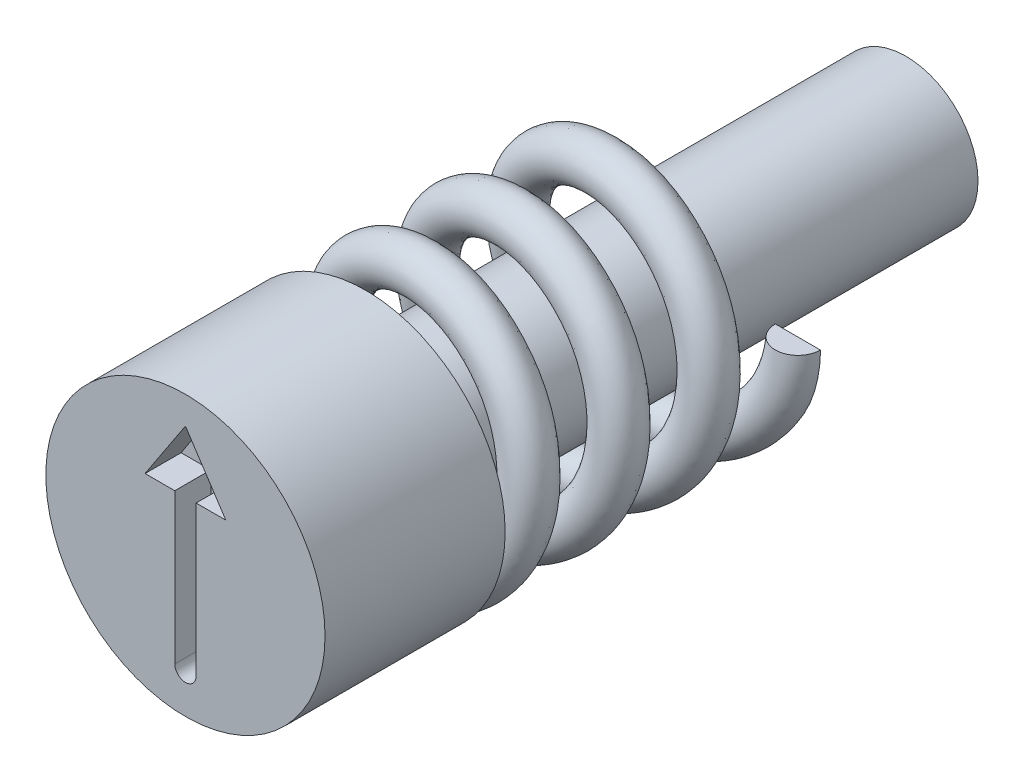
ISO-10303-21;
HEADER;
FILE_DESCRIPTION(('STEP AP214'),'2;1');
FILE_NAME('part.step','',(''),(''),'','','');
FILE_SCHEMA(('AUTOMOTIVE_DESIGN { 1 0 10303 214 1 1 1 1 }'));
ENDSEC;
DATA;
#1=APPLICATION_CONTEXT('core data for automotive mechanical design processes');
#2=APPLICATION_PROTOCOL_DEFINITION('international standard','automotive_design',2000,#1);
#3=PRODUCT_CONTEXT('',#1,'mechanical');
#4=PRODUCT('Part','Part','',(#3));
#5=PRODUCT_RELATED_PRODUCT_CATEGORY('part','',(#4));
#6=PRODUCT_DEFINITION_FORMATION('','',#4);
#7=PRODUCT_DEFINITION_CONTEXT('part definition',#1,'design');
#8=PRODUCT_DEFINITION('design','',#6,#7);
#9=PRODUCT_DEFINITION_SHAPE('','',#8);
#10=(LENGTH_UNIT() NAMED_UNIT(*) SI_UNIT(.MILLI.,.METRE.));
#11=(NAMED_UNIT(*) PLANE_ANGLE_UNIT() SI_UNIT($,.RADIAN.));
#12=(NAMED_UNIT(*) SI_UNIT($,.STERADIAN.) SOLID_ANGLE_UNIT());
#13=UNCERTAINTY_MEASURE_WITH_UNIT(LENGTH_MEASURE(1.E-05),#10,'distance_accuracy_value','');
#14=(GEOMETRIC_REPRESENTATION_CONTEXT(3) GLOBAL_UNCERTAINTY_ASSIGNED_CONTEXT((#13)) GLOBAL_UNIT_ASSIGNED_CONTEXT((#10,
#11,#12)) REPRESENTATION_CONTEXT('',''));
#15=CARTESIAN_POINT('',(0.,0.,0.));
#16=DIRECTION('',(0.,0.,1.));
#17=DIRECTION('',(1.,0.,0.));
#18=AXIS2_PLACEMENT_3D('',#15,#16,#17);
#19=CARTESIAN_POINT('',(1.3,0.,-5.75));
#20=DIRECTION('',(0.,-1.,0.));
#21=DIRECTION('',(0.,0.,-1.));
#22=AXIS2_PLACEMENT_3D('',#19,#20,#21);
#23=PLANE('',#22);
#24=CARTESIAN_POINT('',(1.3,0.,-5.5));
#25=DIRECTION('',(0.,1.,0.));
#26=DIRECTION('',(0.,0.,1.));
#27=AXIS2_PLACEMENT_3D('',#24,#25,#26);
#28=CIRCLE('',#27,0.25);
#29=CARTESIAN_POINT('',(1.05,0.,-5.5));
#30=VERTEX_POINT('',#29);
#31=CARTESIAN_POINT('',(1.55,0.,-5.5));
#32=VERTEX_POINT('',#31);
#33=EDGE_CURVE('E88',#30,#32,#28,.T.);
#34=ORIENTED_EDGE('',*,*,#33,.T.);
#35=DIRECTION('',(-1.,0.,0.));
#36=VECTOR('',#35,1.);
#37=CARTESIAN_POINT('',(1.3,0.,-5.5));
#38=LINE('',#37,#36);
#39=EDGE_CURVE('E75',#32,#30,#38,.T.);
#40=ORIENTED_EDGE('',*,*,#39,.T.);
#41=EDGE_LOOP('',(#34,#40));
#42=FACE_BOUND('',#41,.T.);
#43=ADVANCED_FACE('F49',(#42),#23,.F.);
#44=CARTESIAN_POINT('',(-1.3,0.,-2.25));
#45=DIRECTION('',(0.,1.,0.));
#46=DIRECTION('',(-1.,0.,0.));
#47=AXIS2_PLACEMENT_3D('',#44,#45,#46);
#48=PLANE('',#47);
#49=DIRECTION('',(-1.,0.,0.));
#50=VECTOR('',#49,1.);
#51=CARTESIAN_POINT('',(-1.3,0.,-2.));
#52=LINE('',#51,#50);
#53=CARTESIAN_POINT('',(-1.05,0.,-2.));
#54=VERTEX_POINT('',#53);
#55=CARTESIAN_POINT('',(-1.55,0.,-2.));
#56=VERTEX_POINT('',#55);
#57=EDGE_CURVE('E69',#54,#56,#52,.T.);
#58=ORIENTED_EDGE('',*,*,#57,.F.);
#59=CARTESIAN_POINT('',(-1.3,0.,-2.));
#60=DIRECTION('',(0.,1.,0.));
#61=DIRECTION('',(-1.,0.,0.));
#62=AXIS2_PLACEMENT_3D('',#59,#60,#61);
#63=CIRCLE('',#62,0.25);
#64=EDGE_CURVE('E85',#54,#56,#63,.T.);
#65=ORIENTED_EDGE('',*,*,#64,.T.);
#66=EDGE_LOOP('',(#58,#65));
#67=FACE_BOUND('',#66,.T.);
#68=ADVANCED_FACE('F51',(#67),#48,.T.);
#69=CARTESIAN_POINT('',(1.3,0.,-5.25));
#70=CARTESIAN_POINT('',(1.3,-0.538477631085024,-5.1875));
#71=CARTESIAN_POINT('',(0.919238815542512,-0.919238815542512,-5.125));
#72=CARTESIAN_POINT('',(0.538477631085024,-1.3,-5.0625));
#73=CARTESIAN_POINT('',(0.,-1.3,-5.));
#74=CARTESIAN_POINT('',(-0.538477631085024,-1.3,-4.9375));
#75=CARTESIAN_POINT('',(-0.919238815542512,-0.919238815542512,-4.875));
#76=CARTESIAN_POINT('',(-1.3,-0.538477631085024,-4.8125));
#77=CARTESIAN_POINT('',(-1.3,0.,-4.75));
#78=CARTESIAN_POINT('',(-1.3,0.538477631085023,-4.6875));
#79=CARTESIAN_POINT('',(-0.919238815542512,0.919238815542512,-4.625));
#80=CARTESIAN_POINT('',(-0.538477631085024,1.3,-4.5625));
#81=CARTESIAN_POINT('',(0.,1.3,-4.5));
#82=CARTESIAN_POINT('',(0.538477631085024,1.3,-4.4375));
#83=CARTESIAN_POINT('',(0.919238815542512,0.919238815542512,-4.375));
#84=CARTESIAN_POINT('',(1.3,0.538477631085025,-4.3125));
#85=CARTESIAN_POINT('',(1.3,0.,-4.25));
#86=CARTESIAN_POINT('',(1.3,-0.538477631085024,-4.1875));
#87=CARTESIAN_POINT('',(0.919238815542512,-0.919238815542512,-4.125));
#88=CARTESIAN_POINT('',(0.538477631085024,-1.3,-4.0625));
#89=CARTESIAN_POINT('',(0.,-1.3,-4.));
#90=CARTESIAN_POINT('',(-0.538477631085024,-1.3,-3.9375));
#91=CARTESIAN_POINT('',(-0.919238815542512,-0.919238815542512,-3.875));
#92=CARTESIAN_POINT('',(-1.3,-0.538477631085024,-3.8125));
#93=CARTESIAN_POINT('',(-1.3,0.,-3.75));
#94=CARTESIAN_POINT('',(-1.3,0.538477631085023,-3.6875));
#95=CARTESIAN_POINT('',(-0.919238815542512,0.919238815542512,-3.625));
#96=CARTESIAN_POINT('',(-0.538477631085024,1.3,-3.5625));
#97=CARTESIAN_POINT('',(0.,1.3,-3.5));
#98=CARTESIAN_POINT('',(0.538477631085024,1.3,-3.4375));
#99=CARTESIAN_POINT('',(0.919238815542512,0.919238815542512,-3.375));
#100=CARTESIAN_POINT('',(1.3,0.538477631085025,-3.3125));
#101=CARTESIAN_POINT('',(1.3,0.,-3.25));
#102=CARTESIAN_POINT('',(1.3,-0.538477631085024,-3.1875));
#103=CARTESIAN_POINT('',(0.919238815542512,-0.919238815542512,-3.125));
#104=CARTESIAN_POINT('',(0.538477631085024,-1.3,-3.0625));
#105=CARTESIAN_POINT('',(0.,-1.3,-3.));
#106=CARTESIAN_POINT('',(-0.538477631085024,-1.3,-2.9375));
#107=CARTESIAN_POINT('',(-0.919238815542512,-0.919238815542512,-2.875));
#108=CARTESIAN_POINT('',(-1.3,-0.538477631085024,-2.8125));
#109=CARTESIAN_POINT('',(-1.3,0.,-2.75));
#110=CARTESIAN_POINT('',(-1.3,0.538477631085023,-2.6875));
#111=CARTESIAN_POINT('',(-0.919238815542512,0.919238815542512,-2.625));
#112=CARTESIAN_POINT('',(-0.538477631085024,1.3,-2.5625));
#113=CARTESIAN_POINT('',(0.,1.3,-2.5));
#114=CARTESIAN_POINT('',(0.538477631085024,1.3,-2.4375));
#115=CARTESIAN_POINT('',(0.919238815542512,0.919238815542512,-2.375));
#116=CARTESIAN_POINT('',(1.3,0.538477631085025,-2.3125));
#117=CARTESIAN_POINT('',(1.3,0.,-2.25));
#118=CARTESIAN_POINT('',(1.3,-0.538477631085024,-2.1875));
#119=CARTESIAN_POINT('',(0.919238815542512,-0.919238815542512,-2.125));
#120=CARTESIAN_POINT('',(0.538477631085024,-1.3,-2.0625));
#121=CARTESIAN_POINT('',(0.,-1.3,-2.));
#122=CARTESIAN_POINT('',(-0.538477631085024,-1.3,-1.9375));
#123=CARTESIAN_POINT('',(-0.919238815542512,-0.919238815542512,-1.875));
#124=CARTESIAN_POINT('',(-1.3,-0.538477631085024,-1.8125));
#125=CARTESIAN_POINT('',(-1.3,0.,-1.75));
#126=CARTESIAN_POINT('',(1.8,0.,-5.25));
#127=CARTESIAN_POINT('',(1.8,-0.745584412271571,-5.1875));
#128=CARTESIAN_POINT('',(1.27279220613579,-1.27279220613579,-5.125));
#129=CARTESIAN_POINT('',(0.745584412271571,-1.8,-5.0625));
#130=CARTESIAN_POINT('',(0.,-1.8,-5.));
#131=CARTESIAN_POINT('',(-0.745584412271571,-1.8,-4.9375));
#132=CARTESIAN_POINT('',(-1.27279220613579,-1.27279220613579,-4.875));
#133=CARTESIAN_POINT('',(-1.8,-0.745584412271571,-4.8125));
#134=CARTESIAN_POINT('',(-1.8,0.,-4.75));
#135=CARTESIAN_POINT('',(-1.8,0.745584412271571,-4.6875));
#136=CARTESIAN_POINT('',(-1.27279220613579,1.27279220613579,-4.625));
#137=CARTESIAN_POINT('',(-0.745584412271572,1.8,-4.5625));
#138=CARTESIAN_POINT('',(0.,1.8,-4.5));
#139=CARTESIAN_POINT('',(0.745584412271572,1.8,-4.4375));
#140=CARTESIAN_POINT('',(1.27279220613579,1.27279220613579,-4.375));
#141=CARTESIAN_POINT('',(1.8,0.745584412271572,-4.3125));
#142=CARTESIAN_POINT('',(1.8,0.,-4.25));
#143=CARTESIAN_POINT('',(1.8,-0.745584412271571,-4.1875));
#144=CARTESIAN_POINT('',(1.27279220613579,-1.27279220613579,-4.125));
#145=CARTESIAN_POINT('',(0.745584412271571,-1.8,-4.0625));
#146=CARTESIAN_POINT('',(0.,-1.8,-4.));
#147=CARTESIAN_POINT('',(-0.745584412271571,-1.8,-3.9375));
#148=CARTESIAN_POINT('',(-1.27279220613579,-1.27279220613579,-3.875));
#149=CARTESIAN_POINT('',(-1.8,-0.745584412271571,-3.8125));
#150=CARTESIAN_POINT('',(-1.8,0.,-3.75));
#151=CARTESIAN_POINT('',(-1.8,0.745584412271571,-3.6875));
#152=CARTESIAN_POINT('',(-1.27279220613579,1.27279220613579,-3.625));
#153=CARTESIAN_POINT('',(-0.745584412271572,1.8,-3.5625));
#154=CARTESIAN_POINT('',(0.,1.8,-3.5));
#155=CARTESIAN_POINT('',(0.745584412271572,1.8,-3.4375));
#156=CARTESIAN_POINT('',(1.27279220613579,1.27279220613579,-3.375));
#157=CARTESIAN_POINT('',(1.8,0.745584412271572,-3.3125));
#158=CARTESIAN_POINT('',(1.8,0.,-3.25));
#159=CARTESIAN_POINT('',(1.8,-0.745584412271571,-3.1875));
#160=CARTESIAN_POINT('',(1.27279220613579,-1.27279220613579,-3.125));
#161=CARTESIAN_POINT('',(0.745584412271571,-1.8,-3.0625));
#162=CARTESIAN_POINT('',(0.,-1.8,-3.));
#163=CARTESIAN_POINT('',(-0.745584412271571,-1.8,-2.9375));
#164=CARTESIAN_POINT('',(-1.27279220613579,-1.27279220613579,-2.875));
#165=CARTESIAN_POINT('',(-1.8,-0.745584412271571,-2.8125));
#166=CARTESIAN_POINT('',(-1.8,0.,-2.75));
#167=CARTESIAN_POINT('',(-1.8,0.745584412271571,-2.6875));
#168=CARTESIAN_POINT('',(-1.27279220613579,1.27279220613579,-2.625));
#169=CARTESIAN_POINT('',(-0.745584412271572,1.8,-2.5625));
#170=CARTESIAN_POINT('',(0.,1.8,-2.5));
#171=CARTESIAN_POINT('',(0.745584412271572,1.8,-2.4375));
#172=CARTESIAN_POINT('',(1.27279220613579,1.27279220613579,-2.375));
#173=CARTESIAN_POINT('',(1.8,0.745584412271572,-2.3125));
#174=CARTESIAN_POINT('',(1.8,0.,-2.25));
#175=CARTESIAN_POINT('',(1.8,-0.745584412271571,-2.1875));
#176=CARTESIAN_POINT('',(1.27279220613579,-1.27279220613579,-2.125));
#177=CARTESIAN_POINT('',(0.745584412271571,-1.8,-2.0625));
#178=CARTESIAN_POINT('',(0.,-1.8,-2.));
#179=CARTESIAN_POINT('',(-0.745584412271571,-1.8,-1.9375));
#180=CARTESIAN_POINT('',(-1.27279220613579,-1.27279220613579,-1.875));
#181=CARTESIAN_POINT('',(-1.8,-0.745584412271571,-1.8125));
#182=CARTESIAN_POINT('',(-1.8,0.,-1.75));
#183=CARTESIAN_POINT('',(1.8,0.,-5.75));
#184=CARTESIAN_POINT('',(1.8,-0.745584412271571,-5.6875));
#185=CARTESIAN_POINT('',(1.27279220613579,-1.27279220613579,-5.625));
#186=CARTESIAN_POINT('',(0.745584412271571,-1.8,-5.5625));
#187=CARTESIAN_POINT('',(0.,-1.8,-5.5));
#188=CARTESIAN_POINT('',(-0.745584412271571,-1.8,-5.4375));
#189=CARTESIAN_POINT('',(-1.27279220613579,-1.27279220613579,-5.375));
#190=CARTESIAN_POINT('',(-1.8,-0.745584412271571,-5.3125));
#191=CARTESIAN_POINT('',(-1.8,0.,-5.25));
#192=CARTESIAN_POINT('',(-1.8,0.745584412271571,-5.1875));
#193=CARTESIAN_POINT('',(-1.27279220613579,1.27279220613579,-5.125));
#194=CARTESIAN_POINT('',(-0.745584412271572,1.8,-5.0625));
#195=CARTESIAN_POINT('',(0.,1.8,-5.));
#196=CARTESIAN_POINT('',(0.745584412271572,1.8,-4.9375));
#197=CARTESIAN_POINT('',(1.27279220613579,1.27279220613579,-4.875));
#198=CARTESIAN_POINT('',(1.8,0.745584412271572,-4.8125));
#199=CARTESIAN_POINT('',(1.8,0.,-4.75));
#200=CARTESIAN_POINT('',(1.8,-0.745584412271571,-4.6875));
#201=CARTESIAN_POINT('',(1.27279220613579,-1.27279220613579,-4.625));
#202=CARTESIAN_POINT('',(0.745584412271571,-1.8,-4.5625));
#203=CARTESIAN_POINT('',(0.,-1.8,-4.5));
#204=CARTESIAN_POINT('',(-0.745584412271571,-1.8,-4.4375));
#205=CARTESIAN_POINT('',(-1.27279220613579,-1.27279220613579,-4.375));
#206=CARTESIAN_POINT('',(-1.8,-0.745584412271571,-4.3125));
#207=CARTESIAN_POINT('',(-1.8,0.,-4.25));
#208=CARTESIAN_POINT('',(-1.8,0.745584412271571,-4.1875));
#209=CARTESIAN_POINT('',(-1.27279220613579,1.27279220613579,-4.125));
#210=CARTESIAN_POINT('',(-0.745584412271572,1.8,-4.0625));
#211=CARTESIAN_POINT('',(0.,1.8,-4.));
#212=CARTESIAN_POINT('',(0.745584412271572,1.8,-3.9375));
#213=CARTESIAN_POINT('',(1.27279220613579,1.27279220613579,-3.875));
#214=CARTESIAN_POINT('',(1.8,0.745584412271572,-3.8125));
#215=CARTESIAN_POINT('',(1.8,0.,-3.75));
#216=CARTESIAN_POINT('',(1.8,-0.745584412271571,-3.6875));
#217=CARTESIAN_POINT('',(1.27279220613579,-1.27279220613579,-3.625));
#218=CARTESIAN_POINT('',(0.745584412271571,-1.8,-3.5625));
#219=CARTESIAN_POINT('',(0.,-1.8,-3.5));
#220=CARTESIAN_POINT('',(-0.745584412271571,-1.8,-3.4375));
#221=CARTESIAN_POINT('',(-1.27279220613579,-1.27279220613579,-3.375));
#222=CARTESIAN_POINT('',(-1.8,-0.745584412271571,-3.3125));
#223=CARTESIAN_POINT('',(-1.8,0.,-3.25));
#224=CARTESIAN_POINT('',(-1.8,0.745584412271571,-3.1875));
#225=CARTESIAN_POINT('',(-1.27279220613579,1.27279220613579,-3.125));
#226=CARTESIAN_POINT('',(-0.745584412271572,1.8,-3.0625));
#227=CARTESIAN_POINT('',(0.,1.8,-3.));
#228=CARTESIAN_POINT('',(0.745584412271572,1.8,-2.9375));
#229=CARTESIAN_POINT('',(1.27279220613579,1.27279220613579,-2.875));
#230=CARTESIAN_POINT('',(1.8,0.745584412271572,-2.8125));
#231=CARTESIAN_POINT('',(1.8,0.,-2.75));
#232=CARTESIAN_POINT('',(1.8,-0.745584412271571,-2.6875));
#233=CARTESIAN_POINT('',(1.27279220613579,-1.27279220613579,-2.625));
#234=CARTESIAN_POINT('',(0.745584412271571,-1.8,-2.5625));
#235=CARTESIAN_POINT('',(0.,-1.8,-2.5));
#236=CARTESIAN_POINT('',(-0.745584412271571,-1.8,-2.4375));
#237=CARTESIAN_POINT('',(-1.27279220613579,-1.27279220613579,-2.375));
#238=CARTESIAN_POINT('',(-1.8,-0.745584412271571,-2.3125));
#239=CARTESIAN_POINT('',(-1.8,0.,-2.25));
#240=CARTESIAN_POINT('',(1.3,0.,-5.75));
#241=CARTESIAN_POINT('',(1.3,-0.538477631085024,-5.6875));
#242=CARTESIAN_POINT('',(0.919238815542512,-0.919238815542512,-5.625));
#243=CARTESIAN_POINT('',(0.538477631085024,-1.3,-5.5625));
#244=CARTESIAN_POINT('',(0.,-1.3,-5.5));
#245=CARTESIAN_POINT('',(-0.538477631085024,-1.3,-5.4375));
#246=CARTESIAN_POINT('',(-0.919238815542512,-0.919238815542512,-5.375));
#247=CARTESIAN_POINT('',(-1.3,-0.538477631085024,-5.3125));
#248=CARTESIAN_POINT('',(-1.3,0.,-5.25));
#249=CARTESIAN_POINT('',(-1.3,0.538477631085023,-5.1875));
#250=CARTESIAN_POINT('',(-0.919238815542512,0.919238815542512,-5.125));
#251=CARTESIAN_POINT('',(-0.538477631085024,1.3,-5.0625));
#252=CARTESIAN_POINT('',(0.,1.3,-5.));
#253=CARTESIAN_POINT('',(0.538477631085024,1.3,-4.9375));
#254=CARTESIAN_POINT('',(0.919238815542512,0.919238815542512,-4.875));
#255=CARTESIAN_POINT('',(1.3,0.538477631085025,-4.8125));
#256=CARTESIAN_POINT('',(1.3,0.,-4.75));
#257=CARTESIAN_POINT('',(1.3,-0.538477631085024,-4.6875));
#258=CARTESIAN_POINT('',(0.919238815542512,-0.919238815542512,-4.625));
#259=CARTESIAN_POINT('',(0.538477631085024,-1.3,-4.5625));
#260=CARTESIAN_POINT('',(0.,-1.3,-4.5));
#261=CARTESIAN_POINT('',(-0.538477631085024,-1.3,-4.4375));
#262=CARTESIAN_POINT('',(-0.919238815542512,-0.919238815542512,-4.375));
#263=CARTESIAN_POINT('',(-1.3,-0.538477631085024,-4.3125));
#264=CARTESIAN_POINT('',(-1.3,0.,-4.25));
#265=CARTESIAN_POINT('',(-1.3,0.538477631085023,-4.1875));
#266=CARTESIAN_POINT('',(-0.919238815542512,0.919238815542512,-4.125));
#267=CARTESIAN_POINT('',(-0.538477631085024,1.3,-4.0625));
#268=CARTESIAN_POINT('',(0.,1.3,-4.));
#269=CARTESIAN_POINT('',(0.538477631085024,1.3,-3.9375));
#270=CARTESIAN_POINT('',(0.919238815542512,0.919238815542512,-3.875));
#271=CARTESIAN_POINT('',(1.3,0.538477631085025,-3.8125));
#272=CARTESIAN_POINT('',(1.3,0.,-3.75));
#273=CARTESIAN_POINT('',(1.3,-0.538477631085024,-3.6875));
#274=CARTESIAN_POINT('',(0.919238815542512,-0.919238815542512,-3.625));
#275=CARTESIAN_POINT('',(0.538477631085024,-1.3,-3.5625));
#276=CARTESIAN_POINT('',(0.,-1.3,-3.5));
#277=CARTESIAN_POINT('',(-0.538477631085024,-1.3,-3.4375));
#278=CARTESIAN_POINT('',(-0.919238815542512,-0.919238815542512,-3.375));
#279=CARTESIAN_POINT('',(-1.3,-0.538477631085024,-3.3125));
#280=CARTESIAN_POINT('',(-1.3,0.,-3.25));
#281=CARTESIAN_POINT('',(-1.3,0.538477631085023,-3.1875));
#282=CARTESIAN_POINT('',(-0.919238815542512,0.919238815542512,-3.125));
#283=CARTESIAN_POINT('',(-0.538477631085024,1.3,-3.0625));
#284=CARTESIAN_POINT('',(0.,1.3,-3.));
#285=CARTESIAN_POINT('',(0.538477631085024,1.3,-2.9375));
#286=CARTESIAN_POINT('',(0.919238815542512,0.919238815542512,-2.875));
#287=CARTESIAN_POINT('',(1.3,0.538477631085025,-2.8125));
#288=CARTESIAN_POINT('',(1.3,0.,-2.75));
#289=CARTESIAN_POINT('',(1.3,-0.538477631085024,-2.6875));
#290=CARTESIAN_POINT('',(0.919238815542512,-0.919238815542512,-2.625));
#291=CARTESIAN_POINT('',(0.538477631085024,-1.3,-2.5625));
#292=CARTESIAN_POINT('',(0.,-1.3,-2.5));
#293=CARTESIAN_POINT('',(-0.538477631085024,-1.3,-2.4375));
#294=CARTESIAN_POINT('',(-0.919238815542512,-0.919238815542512,-2.375));
#295=CARTESIAN_POINT('',(-1.3,-0.538477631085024,-2.3125));
#296=CARTESIAN_POINT('',(-1.3,0.,-2.25));
#297=CARTESIAN_POINT('',(0.8,0.,-5.75));
#298=CARTESIAN_POINT('',(0.8,-0.331370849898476,-5.6875));
#299=CARTESIAN_POINT('',(0.565685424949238,-0.565685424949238,-5.625));
#300=CARTESIAN_POINT('',(0.331370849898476,-0.8,-5.5625));
#301=CARTESIAN_POINT('',(0.,-0.8,-5.5));
#302=CARTESIAN_POINT('',(-0.331370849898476,-0.8,-5.4375));
#303=CARTESIAN_POINT('',(-0.565685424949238,-0.565685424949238,-5.375));
#304=CARTESIAN_POINT('',(-0.8,-0.331370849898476,-5.3125));
#305=CARTESIAN_POINT('',(-0.8,0.,-5.25));
#306=CARTESIAN_POINT('',(-0.8,0.331370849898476,-5.1875));
#307=CARTESIAN_POINT('',(-0.565685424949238,0.565685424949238,-5.125));
#308=CARTESIAN_POINT('',(-0.331370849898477,0.8,-5.0625));
#309=CARTESIAN_POINT('',(0.,0.8,-5.));
#310=CARTESIAN_POINT('',(0.331370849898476,0.8,-4.9375));
#311=CARTESIAN_POINT('',(0.565685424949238,0.565685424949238,-4.875));
#312=CARTESIAN_POINT('',(0.8,0.331370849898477,-4.8125));
#313=CARTESIAN_POINT('',(0.8,0.,-4.75));
#314=CARTESIAN_POINT('',(0.8,-0.331370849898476,-4.6875));
#315=CARTESIAN_POINT('',(0.565685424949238,-0.565685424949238,-4.625));
#316=CARTESIAN_POINT('',(0.331370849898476,-0.8,-4.5625));
#317=CARTESIAN_POINT('',(0.,-0.8,-4.5));
#318=CARTESIAN_POINT('',(-0.331370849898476,-0.8,-4.4375));
#319=CARTESIAN_POINT('',(-0.565685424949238,-0.565685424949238,-4.375));
#320=CARTESIAN_POINT('',(-0.8,-0.331370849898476,-4.3125));
#321=CARTESIAN_POINT('',(-0.8,0.,-4.25));
#322=CARTESIAN_POINT('',(-0.8,0.331370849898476,-4.1875));
#323=CARTESIAN_POINT('',(-0.565685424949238,0.565685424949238,-4.125));
#324=CARTESIAN_POINT('',(-0.331370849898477,0.8,-4.0625));
#325=CARTESIAN_POINT('',(0.,0.8,-4.));
#326=CARTESIAN_POINT('',(0.331370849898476,0.8,-3.9375));
#327=CARTESIAN_POINT('',(0.565685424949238,0.565685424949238,-3.875));
#328=CARTESIAN_POINT('',(0.8,0.331370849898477,-3.8125));
#329=CARTESIAN_POINT('',(0.8,0.,-3.75));
#330=CARTESIAN_POINT('',(0.8,-0.331370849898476,-3.6875));
#331=CARTESIAN_POINT('',(0.565685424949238,-0.565685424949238,-3.625));
#332=CARTESIAN_POINT('',(0.331370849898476,-0.8,-3.5625));
#333=CARTESIAN_POINT('',(0.,-0.8,-3.5));
#334=CARTESIAN_POINT('',(-0.331370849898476,-0.8,-3.4375));
#335=CARTESIAN_POINT('',(-0.565685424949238,-0.565685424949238,-3.375));
#336=CARTESIAN_POINT('',(-0.8,-0.331370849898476,-3.3125));
#337=CARTESIAN_POINT('',(-0.8,0.,-3.25));
#338=CARTESIAN_POINT('',(-0.8,0.331370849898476,-3.1875));
#339=CARTESIAN_POINT('',(-0.565685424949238,0.565685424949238,-3.125));
#340=CARTESIAN_POINT('',(-0.331370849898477,0.8,-3.0625));
#341=CARTESIAN_POINT('',(0.,0.8,-3.));
#342=CARTESIAN_POINT('',(0.331370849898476,0.8,-2.9375));
#343=CARTESIAN_POINT('',(0.565685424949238,0.565685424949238,-2.875));
#344=CARTESIAN_POINT('',(0.8,0.331370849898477,-2.8125));
#345=CARTESIAN_POINT('',(0.8,0.,-2.75));
#346=CARTESIAN_POINT('',(0.8,-0.331370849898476,-2.6875));
#347=CARTESIAN_POINT('',(0.565685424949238,-0.565685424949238,-2.625));
#348=CARTESIAN_POINT('',(0.331370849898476,-0.8,-2.5625));
#349=CARTESIAN_POINT('',(0.,-0.8,-2.5));
#350=CARTESIAN_POINT('',(-0.331370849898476,-0.8,-2.4375));
#351=CARTESIAN_POINT('',(-0.565685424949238,-0.565685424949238,-2.375));
#352=CARTESIAN_POINT('',(-0.8,-0.331370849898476,-2.3125));
#353=CARTESIAN_POINT('',(-0.8,0.,-2.25));
#354=CARTESIAN_POINT('',(0.8,0.,-5.25));
#355=CARTESIAN_POINT('',(0.8,-0.331370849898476,-5.1875));
#356=CARTESIAN_POINT('',(0.565685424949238,-0.565685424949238,-5.125));
#357=CARTESIAN_POINT('',(0.331370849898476,-0.8,-5.0625));
#358=CARTESIAN_POINT('',(0.,-0.8,-5.));
#359=CARTESIAN_POINT('',(-0.331370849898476,-0.8,-4.9375));
#360=CARTESIAN_POINT('',(-0.565685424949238,-0.565685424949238,-4.875));
#361=CARTESIAN_POINT('',(-0.8,-0.331370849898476,-4.8125));
#362=CARTESIAN_POINT('',(-0.8,0.,-4.75));
#363=CARTESIAN_POINT('',(-0.8,0.331370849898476,-4.6875));
#364=CARTESIAN_POINT('',(-0.565685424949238,0.565685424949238,-4.625));
#365=CARTESIAN_POINT('',(-0.331370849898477,0.8,-4.5625));
#366=CARTESIAN_POINT('',(0.,0.8,-4.5));
#367=CARTESIAN_POINT('',(0.331370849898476,0.8,-4.4375));
#368=CARTESIAN_POINT('',(0.565685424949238,0.565685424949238,-4.375));
#369=CARTESIAN_POINT('',(0.8,0.331370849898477,-4.3125));
#370=CARTESIAN_POINT('',(0.8,0.,-4.25));
#371=CARTESIAN_POINT('',(0.8,-0.331370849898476,-4.1875));
#372=CARTESIAN_POINT('',(0.565685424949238,-0.565685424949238,-4.125));
#373=CARTESIAN_POINT('',(0.331370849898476,-0.8,-4.0625));
#374=CARTESIAN_POINT('',(0.,-0.8,-4.));
#375=CARTESIAN_POINT('',(-0.331370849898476,-0.8,-3.9375));
#376=CARTESIAN_POINT('',(-0.565685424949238,-0.565685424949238,-3.875));
#377=CARTESIAN_POINT('',(-0.8,-0.331370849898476,-3.8125));
#378=CARTESIAN_POINT('',(-0.8,0.,-3.75));
#379=CARTESIAN_POINT('',(-0.8,0.331370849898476,-3.6875));
#380=CARTESIAN_POINT('',(-0.565685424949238,0.565685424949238,-3.625));
#381=CARTESIAN_POINT('',(-0.331370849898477,0.8,-3.5625));
#382=CARTESIAN_POINT('',(0.,0.8,-3.5));
#383=CARTESIAN_POINT('',(0.331370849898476,0.8,-3.4375));
#384=CARTESIAN_POINT('',(0.565685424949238,0.565685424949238,-3.375));
#385=CARTESIAN_POINT('',(0.8,0.331370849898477,-3.3125));
#386=CARTESIAN_POINT('',(0.8,0.,-3.25));
#387=CARTESIAN_POINT('',(0.8,-0.331370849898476,-3.1875));
#388=CARTESIAN_POINT('',(0.565685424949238,-0.565685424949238,-3.125));
#389=CARTESIAN_POINT('',(0.331370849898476,-0.8,-3.0625));
#390=CARTESIAN_POINT('',(0.,-0.8,-3.));
#391=CARTESIAN_POINT('',(-0.331370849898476,-0.8,-2.9375));
#392=CARTESIAN_POINT('',(-0.565685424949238,-0.565685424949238,-2.875));
#393=CARTESIAN_POINT('',(-0.8,-0.331370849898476,-2.8125));
#394=CARTESIAN_POINT('',(-0.8,0.,-2.75));
#395=CARTESIAN_POINT('',(-0.8,0.331370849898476,-2.6875));
#396=CARTESIAN_POINT('',(-0.565685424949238,0.565685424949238,-2.625));
#397=CARTESIAN_POINT('',(-0.331370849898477,0.8,-2.5625));
#398=CARTESIAN_POINT('',(0.,0.8,-2.5));
#399=CARTESIAN_POINT('',(0.331370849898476,0.8,-2.4375));
#400=CARTESIAN_POINT('',(0.565685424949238,0.565685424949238,-2.375));
#401=CARTESIAN_POINT('',(0.8,0.331370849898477,-2.3125));
#402=CARTESIAN_POINT('',(0.8,0.,-2.25));
#403=CARTESIAN_POINT('',(0.8,-0.331370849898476,-2.1875));
#404=CARTESIAN_POINT('',(0.565685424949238,-0.565685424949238,-2.125));
#405=CARTESIAN_POINT('',(0.331370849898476,-0.8,-2.0625));
#406=CARTESIAN_POINT('',(0.,-0.8,-2.));
#407=CARTESIAN_POINT('',(-0.331370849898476,-0.8,-1.9375));
#408=CARTESIAN_POINT('',(-0.565685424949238,-0.565685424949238,-1.875));
#409=CARTESIAN_POINT('',(-0.8,-0.331370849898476,-1.8125));
#410=CARTESIAN_POINT('',(-0.8,0.,-1.75));
#411=CARTESIAN_POINT('',(1.3,0.,-5.25));
#412=CARTESIAN_POINT('',(1.3,-0.538477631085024,-5.1875));
#413=CARTESIAN_POINT('',(0.919238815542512,-0.919238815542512,-5.125));
#414=CARTESIAN_POINT('',(0.538477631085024,-1.3,-5.0625));
#415=CARTESIAN_POINT('',(0.,-1.3,-5.));
#416=CARTESIAN_POINT('',(-0.538477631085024,-1.3,-4.9375));
#417=CARTESIAN_POINT('',(-0.919238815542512,-0.919238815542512,-4.875));
#418=CARTESIAN_POINT('',(-1.3,-0.538477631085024,-4.8125));
#419=CARTESIAN_POINT('',(-1.3,0.,-4.75));
#420=CARTESIAN_POINT('',(-1.3,0.538477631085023,-4.6875));
#421=CARTESIAN_POINT('',(-0.919238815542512,0.919238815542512,-4.625));
#422=CARTESIAN_POINT('',(-0.538477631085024,1.3,-4.5625));
#423=CARTESIAN_POINT('',(0.,1.3,-4.5));
#424=CARTESIAN_POINT('',(0.538477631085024,1.3,-4.4375));
#425=CARTESIAN_POINT('',(0.919238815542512,0.919238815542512,-4.375));
#426=CARTESIAN_POINT('',(1.3,0.538477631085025,-4.3125));
#427=CARTESIAN_POINT('',(1.3,0.,-4.25));
#428=CARTESIAN_POINT('',(1.3,-0.538477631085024,-4.1875));
#429=CARTESIAN_POINT('',(0.919238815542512,-0.919238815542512,-4.125));
#430=CARTESIAN_POINT('',(0.538477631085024,-1.3,-4.0625));
#431=CARTESIAN_POINT('',(0.,-1.3,-4.));
#432=CARTESIAN_POINT('',(-0.538477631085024,-1.3,-3.9375));
#433=CARTESIAN_POINT('',(-0.919238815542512,-0.919238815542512,-3.875));
#434=CARTESIAN_POINT('',(-1.3,-0.538477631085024,-3.8125));
#435=CARTESIAN_POINT('',(-1.3,0.,-3.75));
#436=CARTESIAN_POINT('',(-1.3,0.538477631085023,-3.6875));
#437=CARTESIAN_POINT('',(-0.919238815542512,0.919238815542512,-3.625));
#438=CARTESIAN_POINT('',(-0.538477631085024,1.3,-3.5625));
#439=CARTESIAN_POINT('',(0.,1.3,-3.5));
#440=CARTESIAN_POINT('',(0.538477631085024,1.3,-3.4375));
#441=CARTESIAN_POINT('',(0.919238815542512,0.919238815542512,-3.375));
#442=CARTESIAN_POINT('',(1.3,0.538477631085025,-3.3125));
#443=CARTESIAN_POINT('',(1.3,0.,-3.25));
#444=CARTESIAN_POINT('',(1.3,-0.538477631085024,-3.1875));
#445=CARTESIAN_POINT('',(0.919238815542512,-0.919238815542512,-3.125));
#446=CARTESIAN_POINT('',(0.538477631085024,-1.3,-3.0625));
#447=CARTESIAN_POINT('',(0.,-1.3,-3.));
#448=CARTESIAN_POINT('',(-0.538477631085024,-1.3,-2.9375));
#449=CARTESIAN_POINT('',(-0.919238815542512,-0.919238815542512,-2.875));
#450=CARTESIAN_POINT('',(-1.3,-0.538477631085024,-2.8125));
#451=CARTESIAN_POINT('',(-1.3,0.,-2.75));
#452=CARTESIAN_POINT('',(-1.3,0.538477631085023,-2.6875));
#453=CARTESIAN_POINT('',(-0.919238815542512,0.919238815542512,-2.625));
#454=CARTESIAN_POINT('',(-0.538477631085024,1.3,-2.5625));
#455=CARTESIAN_POINT('',(0.,1.3,-2.5));
#456=CARTESIAN_POINT('',(0.538477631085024,1.3,-2.4375));
#457=CARTESIAN_POINT('',(0.919238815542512,0.919238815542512,-2.375));
#458=CARTESIAN_POINT('',(1.3,0.538477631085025,-2.3125));
#459=CARTESIAN_POINT('',(1.3,0.,-2.25));
#460=CARTESIAN_POINT('',(1.3,-0.538477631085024,-2.1875));
#461=CARTESIAN_POINT('',(0.919238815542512,-0.919238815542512,-2.125));
#462=CARTESIAN_POINT('',(0.538477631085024,-1.3,-2.0625));
#463=CARTESIAN_POINT('',(0.,-1.3,-2.));
#464=CARTESIAN_POINT('',(-0.538477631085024,-1.3,-1.9375));
#465=CARTESIAN_POINT('',(-0.919238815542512,-0.919238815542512,-1.875));
#466=CARTESIAN_POINT('',(-1.3,-0.538477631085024,-1.8125));
#467=CARTESIAN_POINT('',(-1.3,0.,-1.75));
#468=(BOUNDED_SURFACE() B_SPLINE_SURFACE(3,2,((#69,#70,#71,#72,#73,#74,#75,#76,#77,#78,#79,#80,
#81,#82,#83,#84,#85,#86,#87,#88,#89,#90,#91,#92,#93,#94,#95,#96,#97,#98,#99,#100,#101,#102,#103,
#104,#105,#106,#107,#108,#109,#110,#111,#112,#113,#114,#115,#116,#117,#118,#119,#120,#121,#122,
#123,#124,#125),(#126,#127,#128,#129,#130,#131,#132,#133,#134,#135,#136,#137,#138,#139,#140,
#141,#142,#143,#144,#145,#146,#147,#148,#149,#150,#151,#152,#153,#154,#155,#156,#157,#158,#159,
#160,#161,#162,#163,#164,#165,#166,#167,#168,#169,#170,#171,#172,#173,#174,#175,#176,#177,#178,
#179,#180,#181,#182),(#183,#184,#185,#186,#187,#188,#189,#190,#191,#192,#193,#194,#195,#196,
#197,#198,#199,#200,#201,#202,#203,#204,#205,#206,#207,#208,#209,#210,#211,#212,#213,#214,#215,
#216,#217,#218,#219,#220,#221,#222,#223,#224,#225,#226,#227,#228,#229,#230,#231,#232,#233,#234,
#235,#236,#237,#238,#239),(#240,#241,#242,#243,#244,#245,#246,#247,#248,#249,#250,#251,#252,
#253,#254,#255,#256,#257,#258,#259,#260,#261,#262,#263,#264,#265,#266,#267,#268,#269,#270,#271,
#272,#273,#274,#275,#276,#277,#278,#279,#280,#281,#282,#283,#284,#285,#286,#287,#288,#289,#290,
#291,#292,#293,#294,#295,#296),(#297,#298,#299,#300,#301,#302,#303,#304,#305,#306,#307,#308,
#309,#310,#311,#312,#313,#314,#315,#316,#317,#318,#319,#320,#321,#322,#323,#324,#325,#326,#327,
#328,#329,#330,#331,#332,#333,#334,#335,#336,#337,#338,#339,#340,#341,#342,#343,#344,#345,#346,
#347,#348,#349,#350,#351,#352,#353),(#354,#355,#356,#357,#358,#359,#360,#361,#362,#363,#364,
#365,#366,#367,#368,#369,#370,#371,#372,#373,#374,#375,#376,#377,#378,#379,#380,#381,#382,#383,
#384,#385,#386,#387,#388,#389,#390,#391,#392,#393,#394,#395,#396,#397,#398,#399,#400,#401,#402,
#403,#404,#405,#406,#407,#408,#409,#410),(#411,#412,#413,#414,#415,#416,#417,#418,#419,#420,
#421,#422,#423,#424,#425,#426,#427,#428,#429,#430,#431,#432,#433,#434,#435,#436,#437,#438,#439,
#440,#441,#442,#443,#444,#445,#446,#447,#448,#449,#450,#451,#452,#453,#454,#455,#456,#457,#458,
#459,#460,#461,#462,#463,#464,#465,#466,#467)),.UNSPECIFIED.,.T.,.F.,
.F.) B_SPLINE_SURFACE_WITH_KNOTS((4,3,4),(3,2,2,2,2,2,2,2,2,2,2,2,2,2,2,2,2,2,2,2,2,2,2,2,2,2,2,
2,3),(0.,0.5,1.),(0.,0.03125,0.0625,0.09375,0.125,0.15625,0.1875,0.21875,0.25,0.28125,0.3125,
0.34375,0.375,0.40625,0.4375,0.46875,0.5,0.53125,0.5625,0.59375,0.625,0.65625,0.6875,0.71875,
0.75,0.78125,0.8125,0.84375,0.875),
.UNSPECIFIED.) GEOMETRIC_REPRESENTATION_ITEM() RATIONAL_B_SPLINE_SURFACE(((1.,0.923879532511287,
1.,0.923879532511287,1.,0.923879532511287,1.,0.923879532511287,1.,0.923879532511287,1.,
0.923879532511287,1.,0.923879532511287,1.,0.923879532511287,1.,0.923879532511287,1.,
0.923879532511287,1.,0.923879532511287,1.,0.923879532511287,1.,0.923879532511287,1.,
0.923879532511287,1.,0.923879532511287,1.,0.923879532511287,1.,0.923879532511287,1.,
0.923879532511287,1.,0.923879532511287,1.,0.923879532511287,1.,0.923879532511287,1.,
0.923879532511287,1.,0.923879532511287,1.,0.923879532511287,1.,0.923879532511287,1.,
0.923879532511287,1.,0.923879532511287,1.,0.923879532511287,1.),(0.333333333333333,
0.307959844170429,0.333333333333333,0.307959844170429,0.333333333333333,0.307959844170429,
0.333333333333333,0.307959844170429,0.333333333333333,0.307959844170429,0.333333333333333,
0.307959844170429,0.333333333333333,0.307959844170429,0.333333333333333,0.307959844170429,
0.333333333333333,0.307959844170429,0.333333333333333,0.307959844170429,0.333333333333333,
0.307959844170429,0.333333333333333,0.307959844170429,0.333333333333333,0.307959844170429,
0.333333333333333,0.307959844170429,0.333333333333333,0.307959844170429,0.333333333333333,
0.307959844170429,0.333333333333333,0.307959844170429,0.333333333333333,0.307959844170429,
0.333333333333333,0.307959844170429,0.333333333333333,0.307959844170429,0.333333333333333,
0.307959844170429,0.333333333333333,0.307959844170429,0.333333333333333,0.307959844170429,
0.333333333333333,0.307959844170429,0.333333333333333,0.307959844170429,0.333333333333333,
0.307959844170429,0.333333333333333,0.307959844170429,0.333333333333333,0.307959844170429,
0.333333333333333),(0.333333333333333,0.307959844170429,0.333333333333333,0.307959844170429,
0.333333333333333,0.307959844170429,0.333333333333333,0.307959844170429,0.333333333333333,
0.307959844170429,0.333333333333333,0.307959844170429,0.333333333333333,0.307959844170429,
0.333333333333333,0.307959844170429,0.333333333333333,0.307959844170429,0.333333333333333,
0.307959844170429,0.333333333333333,0.307959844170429,0.333333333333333,0.307959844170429,
0.333333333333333,0.307959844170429,0.333333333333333,0.307959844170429,0.333333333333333,
0.307959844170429,0.333333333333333,0.307959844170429,0.333333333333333,0.307959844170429,
0.333333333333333,0.307959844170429,0.333333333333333,0.307959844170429,0.333333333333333,
0.307959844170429,0.333333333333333,0.307959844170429,0.333333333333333,0.307959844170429,
0.333333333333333,0.307959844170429,0.333333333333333,0.307959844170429,0.333333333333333,
0.307959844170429,0.333333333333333,0.307959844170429,0.333333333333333,0.307959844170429,
0.333333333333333,0.307959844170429,0.333333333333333),(1.,0.923879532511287,1.,
0.923879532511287,1.,0.923879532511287,1.,0.923879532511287,1.,0.923879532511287,1.,
0.923879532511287,1.,0.923879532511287,1.,0.923879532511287,1.,0.923879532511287,1.,
0.923879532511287,1.,0.923879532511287,1.,0.923879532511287,1.,0.923879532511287,1.,
0.923879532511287,1.,0.923879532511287,1.,0.923879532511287,1.,0.923879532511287,1.,
0.923879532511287,1.,0.923879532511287,1.,0.923879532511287,1.,0.923879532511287,1.,
0.923879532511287,1.,0.923879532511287,1.,0.923879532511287,1.,0.923879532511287,1.,
0.923879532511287,1.,0.923879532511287,1.,0.923879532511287,1.),(0.333333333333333,
0.307959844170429,0.333333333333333,0.307959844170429,0.333333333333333,0.307959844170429,
0.333333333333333,0.307959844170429,0.333333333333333,0.307959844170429,0.333333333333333,
0.307959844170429,0.333333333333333,0.307959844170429,0.333333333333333,0.307959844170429,
0.333333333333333,0.307959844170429,0.333333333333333,0.307959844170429,0.333333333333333,
0.307959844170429,0.333333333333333,0.307959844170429,0.333333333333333,0.307959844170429,
0.333333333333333,0.307959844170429,0.333333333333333,0.307959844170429,0.333333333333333,
0.307959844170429,0.333333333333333,0.307959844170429,0.333333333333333,0.307959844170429,
0.333333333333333,0.307959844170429,0.333333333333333,0.307959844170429,0.333333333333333,
0.307959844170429,0.333333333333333,0.307959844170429,0.333333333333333,0.307959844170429,
0.333333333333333,0.307959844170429,0.333333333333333,0.307959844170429,0.333333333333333,
0.307959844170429,0.333333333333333,0.307959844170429,0.333333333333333,0.307959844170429,
0.333333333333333),(0.333333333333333,0.307959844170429,0.333333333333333,0.307959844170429,
0.333333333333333,0.307959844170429,0.333333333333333,0.307959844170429,0.333333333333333,
0.307959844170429,0.333333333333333,0.307959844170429,0.333333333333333,0.307959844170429,
0.333333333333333,0.307959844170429,0.333333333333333,0.307959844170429,0.333333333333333,
0.307959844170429,0.333333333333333,0.307959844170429,0.333333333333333,0.307959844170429,
0.333333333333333,0.307959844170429,0.333333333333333,0.307959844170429,0.333333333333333,
0.307959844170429,0.333333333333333,0.307959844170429,0.333333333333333,0.307959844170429,
0.333333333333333,0.307959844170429,0.333333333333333,0.307959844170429,0.333333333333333,
0.307959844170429,0.333333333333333,0.307959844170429,0.333333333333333,0.307959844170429,
0.333333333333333,0.307959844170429,0.333333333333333,0.307959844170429,0.333333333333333,
0.307959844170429,0.333333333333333,0.307959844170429,0.333333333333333,0.307959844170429,
0.333333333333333,0.307959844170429,0.333333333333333),(1.,0.923879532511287,1.,
0.923879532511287,1.,0.923879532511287,1.,0.923879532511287,1.,0.923879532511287,1.,
0.923879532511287,1.,0.923879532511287,1.,0.923879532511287,1.,0.923879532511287,1.,
0.923879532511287,1.,0.923879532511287,1.,0.923879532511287,1.,0.923879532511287,1.,
0.923879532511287,1.,0.923879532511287,1.,0.923879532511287,1.,0.923879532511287,1.,
0.923879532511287,1.,0.923879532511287,1.,0.923879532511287,1.,0.923879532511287,1.,
0.923879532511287,1.,0.923879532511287,1.,0.923879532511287,1.,0.923879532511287,1.,
0.923879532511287,1.,0.923879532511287,1.,0.923879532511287,1.))) REPRESENTATION_ITEM('') SURFACE());
#469=CARTESIAN_POINT('',(1.05,0.,-5.5));
#470=CARTESIAN_POINT('',(1.05004023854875,-0.065567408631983,-5.5));
#471=CARTESIAN_POINT('',(1.04439509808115,-0.131091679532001,-5.5));
#472=CARTESIAN_POINT('',(1.02231800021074,-0.260106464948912,-5.5));
#473=CARTESIAN_POINT('',(1.00591764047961,-0.323602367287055,-5.5));
#474=CARTESIAN_POINT('',(0.962903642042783,-0.447028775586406,-5.5));
#475=CARTESIAN_POINT('',(0.936288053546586,-0.506958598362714,-5.5));
#476=CARTESIAN_POINT('',(0.873593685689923,-0.621757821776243,-5.5));
#477=CARTESIAN_POINT('',(0.837506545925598,-0.676622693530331,-5.5));
#478=CARTESIAN_POINT('',(0.77655938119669,-0.754465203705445,-5.5));
#479=CARTESIAN_POINT('',(0.754811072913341,-0.779941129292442,-5.5));
#480=CARTESIAN_POINT('',(0.709428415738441,-0.829161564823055,-5.5));
#481=CARTESIAN_POINT('',(0.68579390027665,-0.852905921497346,-5.5));
#482=CARTESIAN_POINT('',(0.636876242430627,-0.898528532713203,-5.5));
#483=CARTESIAN_POINT('',(0.611596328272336,-0.920410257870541,-5.50000000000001));
#484=CARTESIAN_POINT('',(0.55955004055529,-0.962330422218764,-5.49999999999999));
#485=CARTESIAN_POINT('',(0.532783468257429,-0.982368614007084,-5.49999999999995));
#486=CARTESIAN_POINT('',(0.474625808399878,-1.02294574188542,-5.49999999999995));
#487=CARTESIAN_POINT('',(0.443069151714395,-1.0432469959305,-5.49999999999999));
#488=CARTESIAN_POINT('',(0.378684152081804,-1.08165783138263,-5.50000000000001));
#489=CARTESIAN_POINT('',(0.34585658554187,-1.0997687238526,-5.49999999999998));
#490=CARTESIAN_POINT('',(0.279249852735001,-1.13413514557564,-5.50000000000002));
#491=CARTESIAN_POINT('',(0.245470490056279,-1.15039028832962,-5.50000000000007));
#492=CARTESIAN_POINT('',(0.194442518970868,-1.17406361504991,-5.49999999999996));
#493=CARTESIAN_POINT('',(0.177356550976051,-1.181843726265,-5.4999999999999));
#494=CARTESIAN_POINT('',(0.143194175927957,-1.19741723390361,-5.5000000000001));
#495=CARTESIAN_POINT('',(0.126117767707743,-1.2052106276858,-5.50000000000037));
#496=CARTESIAN_POINT('',(0.097135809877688,-1.21897868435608,-5.4999999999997));
#497=CARTESIAN_POINT('',(0.0851707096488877,-1.22482314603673,-5.49999999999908));
#498=CARTESIAN_POINT('',(0.0675074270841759,-1.23410189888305,-5.50000000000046));
#499=CARTESIAN_POINT('',(0.0616740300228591,-1.23727596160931,-5.5000000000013));
#500=CARTESIAN_POINT('',(0.0501655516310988,-1.24389672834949,-5.4999999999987));
#501=CARTESIAN_POINT('',(0.0444903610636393,-1.24734323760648,-5.49999999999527));
#502=CARTESIAN_POINT('',(0.0333338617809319,-1.25473509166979,-5.49999999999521));
#503=CARTESIAN_POINT('',(0.0278573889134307,-1.25868782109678,-5.4999999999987));
#504=CARTESIAN_POINT('',(0.0175458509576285,-1.26732506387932,-5.50000000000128));
#505=CARTESIAN_POINT('',(0.012704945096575,-1.27200190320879,-5.50000000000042));
#506=CARTESIAN_POINT('',(0.0059212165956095,-1.28099175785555,-5.49999999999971));
#507=CARTESIAN_POINT('',(0.00354675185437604,-1.28494182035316,-5.49999999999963));
#508=CARTESIAN_POINT('',(0.000796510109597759,-1.29247828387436,-5.50000000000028));
#509=CARTESIAN_POINT('',(7.79755926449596E-05,-1.29592472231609,-5.50000000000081));
#510=CARTESIAN_POINT('',(-6.5274644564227E-05,-1.30286100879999,-5.49999999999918));
#511=CARTESIAN_POINT('',(0.000513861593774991,-1.30635095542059,-5.49999999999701));
#512=CARTESIAN_POINT('',(0.00300622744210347,-1.31380427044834,-5.49999999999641));
#513=CARTESIAN_POINT('',(0.00522788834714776,-1.3176538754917,-5.4999999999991));
#514=CARTESIAN_POINT('',(0.0101313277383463,-1.32417868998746,-5.50000000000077));
#515=CARTESIAN_POINT('',(0.0127082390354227,-1.32694255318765,-5.50000000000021));
#516=CARTESIAN_POINT('',(0.0182244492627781,-1.33209256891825,-5.49999999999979));
#517=CARTESIAN_POINT('',(0.0211647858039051,-1.33447759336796,-5.49999999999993));
#518=CARTESIAN_POINT('',(0.0285488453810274,-1.33989164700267,-5.50000000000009));
#519=CARTESIAN_POINT('',(0.0331026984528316,-1.34276677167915,-5.50000000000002));
#520=CARTESIAN_POINT('',(0.042460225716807,-1.34808354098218,-5.49999999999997));
#521=CARTESIAN_POINT('',(0.0472643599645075,-1.35052434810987,-5.49999999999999));
#522=CARTESIAN_POINT('',(0.0619457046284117,-1.35736545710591,-5.50000000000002));
#523=CARTESIAN_POINT('',(0.0720556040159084,-1.36126112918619,-5.50000000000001));
#524=CARTESIAN_POINT('',(0.0972888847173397,-1.36974121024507,-5.49999999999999));
#525=CARTESIAN_POINT('',(0.112575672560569,-1.37381572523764,-5.5));
#526=CARTESIAN_POINT('',(0.143457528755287,-1.38061388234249,-5.5));
#527=CARTESIAN_POINT('',(0.159053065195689,-1.38333527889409,-5.5));
#528=CARTESIAN_POINT('',(0.206067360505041,-1.38986942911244,-5.5));
#529=CARTESIAN_POINT('',(0.237714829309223,-1.39205243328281,-5.5));
#530=CARTESIAN_POINT('',(0.297580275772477,-1.39298687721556,-5.5));
#531=CARTESIAN_POINT('',(0.325797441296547,-1.3920852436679,-5.5));
#532=CARTESIAN_POINT('',(0.382068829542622,-1.38789906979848,-5.5));
#533=CARTESIAN_POINT('',(0.410122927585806,-1.38461289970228,-5.5));
#534=CARTESIAN_POINT('',(0.493742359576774,-1.37149669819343,-5.5));
#535=CARTESIAN_POINT('',(0.548817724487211,-1.35840893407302,-5.5));
#536=CARTESIAN_POINT('',(0.659113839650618,-1.32380814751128,-5.5));
#537=CARTESIAN_POINT('',(0.714214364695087,-1.30192043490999,-5.5));
#538=CARTESIAN_POINT('',(0.820816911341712,-1.25066508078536,-5.5));
#539=CARTESIAN_POINT('',(0.872319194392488,-1.22129798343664,-5.5));
#540=CARTESIAN_POINT('',(0.951039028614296,-1.16910877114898,-5.5));
#541=CARTESIAN_POINT('',(0.979689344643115,-1.1484081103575,-5.5));
#542=CARTESIAN_POINT('',(1.03522901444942,-1.10481371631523,-5.5));
#543=CARTESIAN_POINT('',(1.0621197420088,-1.08192172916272,-5.5));
#544=CARTESIAN_POINT('',(1.14014024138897,-1.0102732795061,-5.5));
#545=CARTESIAN_POINT('',(1.18859870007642,-0.95855756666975,-5.49999999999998));
#546=CARTESIAN_POINT('',(1.28158465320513,-0.843172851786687,-5.50000000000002));
#547=CARTESIAN_POINT('',(1.32527713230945,-0.778831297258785,-5.50000000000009));
#548=CARTESIAN_POINT('',(1.40165140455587,-0.643915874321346,-5.49999999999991));
#549=CARTESIAN_POINT('',(1.43433050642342,-0.573340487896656,-5.49999999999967));
#550=CARTESIAN_POINT('',(1.49049812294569,-0.420680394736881,-5.49999999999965));
#551=CARTESIAN_POINT('',(1.51277935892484,-0.338144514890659,-5.49999999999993));
#552=CARTESIAN_POINT('',(1.53509699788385,-0.212413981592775,-5.50000000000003));
#553=CARTESIAN_POINT('',(1.54068551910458,-0.170128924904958,-5.50000000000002));
#554=CARTESIAN_POINT('',(1.54813644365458,-0.085236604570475,-5.49999999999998));
#555=CARTESIAN_POINT('',(1.54999929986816,-0.0426293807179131,-5.49999999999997));
#556=CARTESIAN_POINT('',(1.55,0.,-5.5));
#557=B_SPLINE_CURVE_WITH_KNOTS('',3,(#469,#470,#471,#472,#473,#474,#475,#476,#477,#478,#479,
#480,#481,#482,#483,#484,#485,#486,#487,#488,#489,#490,#491,#492,#493,#494,#495,#496,#497,#498,
#499,#500,#501,#502,#503,#504,#505,#506,#507,#508,#509,#510,#511,#512,#513,#514,#515,#516,#517,
#518,#519,#520,#521,#522,#523,#524,#525,#526,#527,#528,#529,#530,#531,#532,#533,#534,#535,#536,
#537,#538,#539,#540,#541,#542,#543,#544,#545,#546,#547,#548,#549,#550,#551,#552,#553,#554,#555,
#556),.UNSPECIFIED.,.F.,.F.,(4,2,2,2,2,2,2,2,2,2,2,2,2,2,2,2,2,2,2,2,2,2,2,2,2,2,2,2,2,2,2,2,2,
2,2,2,2,2,2,2,2,2,2,4),(0.,0.19640139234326,0.392228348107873,0.588092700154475,
0.784130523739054,0.884529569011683,0.984937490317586,1.08515402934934,1.18538399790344,
1.29785399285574,1.4102563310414,1.52268203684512,1.5790047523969,1.6353173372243,
1.67525333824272,1.69517261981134,1.71507778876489,1.73531616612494,1.75535313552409,
1.76897470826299,1.77932961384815,1.7897152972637,1.80280846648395,1.81410624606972,
1.82543706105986,1.84155724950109,1.857708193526,1.89013811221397,1.9375125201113,
1.98496528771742,2.07986766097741,2.16446347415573,2.24911716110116,2.41826767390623,
2.59554760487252,2.7728146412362,2.87875081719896,2.98460327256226,3.19637847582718,
3.42866036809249,3.66099898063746,3.91599867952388,4.04381665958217,4.17161910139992),.UNSPECIFIED.);
#558=EDGE_CURVE('E63',#30,#32,#557,.T.);
#559=CARTESIAN_POINT('',(-1.05,0.,-2.));
#560=CARTESIAN_POINT('',(-1.05004023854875,-0.0655674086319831,-2.));
#561=CARTESIAN_POINT('',(-1.04439509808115,-0.131091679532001,-2.));
#562=CARTESIAN_POINT('',(-1.02231800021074,-0.260106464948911,-2.));
#563=CARTESIAN_POINT('',(-1.00591764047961,-0.323602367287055,-2.));
#564=CARTESIAN_POINT('',(-0.962903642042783,-0.447028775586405,-2.));
#565=CARTESIAN_POINT('',(-0.936288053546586,-0.506958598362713,-2.));
#566=CARTESIAN_POINT('',(-0.873593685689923,-0.621757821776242,-2.));
#567=CARTESIAN_POINT('',(-0.837506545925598,-0.676622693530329,-2.));
#568=CARTESIAN_POINT('',(-0.776559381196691,-0.754465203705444,-2.));
#569=CARTESIAN_POINT('',(-0.754811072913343,-0.779941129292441,-2.));
#570=CARTESIAN_POINT('',(-0.709428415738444,-0.829161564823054,-2.));
#571=CARTESIAN_POINT('',(-0.685793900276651,-0.852905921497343,-2.));
#572=CARTESIAN_POINT('',(-0.636876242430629,-0.8985285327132,-2.));
#573=CARTESIAN_POINT('',(-0.611596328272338,-0.920410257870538,-1.99999999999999));
#574=CARTESIAN_POINT('',(-0.559550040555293,-0.962330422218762,-2.00000000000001));
#575=CARTESIAN_POINT('',(-0.532783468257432,-0.982368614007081,-2.00000000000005));
#576=CARTESIAN_POINT('',(-0.474625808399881,-1.02294574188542,-2.00000000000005));
#577=CARTESIAN_POINT('',(-0.4430691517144,-1.0432469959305,-2.00000000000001));
#578=CARTESIAN_POINT('',(-0.378684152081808,-1.08165783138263,-1.99999999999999));
#579=CARTESIAN_POINT('',(-0.345856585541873,-1.09976872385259,-2.00000000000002));
#580=CARTESIAN_POINT('',(-0.279249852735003,-1.13413514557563,-1.99999999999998));
#581=CARTESIAN_POINT('',(-0.245470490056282,-1.15039028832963,-1.99999999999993));
#582=CARTESIAN_POINT('',(-0.19444251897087,-1.17406361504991,-2.00000000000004));
#583=CARTESIAN_POINT('',(-0.177356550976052,-1.181843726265,-2.0000000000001));
#584=CARTESIAN_POINT('',(-0.143194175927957,-1.1974172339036,-1.9999999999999));
#585=CARTESIAN_POINT('',(-0.126117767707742,-1.2052106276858,-1.99999999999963));
#586=CARTESIAN_POINT('',(-0.0971358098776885,-1.21897868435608,-2.0000000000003));
#587=CARTESIAN_POINT('',(-0.0851707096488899,-1.22482314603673,-2.00000000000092));
#588=CARTESIAN_POINT('',(-0.0675074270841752,-1.23410189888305,-1.99999999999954));
#589=CARTESIAN_POINT('',(-0.0616740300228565,-1.23727596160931,-1.9999999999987));
#590=CARTESIAN_POINT('',(-0.0501655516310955,-1.24389672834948,-2.0000000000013));
#591=CARTESIAN_POINT('',(-0.0444903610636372,-1.24734323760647,-2.00000000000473));
#592=CARTESIAN_POINT('',(-0.0333338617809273,-1.25473509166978,-2.00000000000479));
#593=CARTESIAN_POINT('',(-0.0278573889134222,-1.25868782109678,-2.0000000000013));
#594=CARTESIAN_POINT('',(-0.0175458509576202,-1.26732506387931,-1.99999999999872));
#595=CARTESIAN_POINT('',(-0.0127049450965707,-1.27200190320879,-1.99999999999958));
#596=CARTESIAN_POINT('',(-0.00592121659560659,-1.28099175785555,-2.00000000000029));
#597=CARTESIAN_POINT('',(-0.00354675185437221,-1.28494182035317,-2.00000000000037));
#598=CARTESIAN_POINT('',(-0.000796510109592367,-1.29247828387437,-1.99999999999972));
#599=CARTESIAN_POINT('',(-7.79755926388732E-05,-1.2959247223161,-1.99999999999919));
#600=CARTESIAN_POINT('',(6.52746445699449E-05,-1.30286100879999,-2.00000000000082));
#601=CARTESIAN_POINT('',(-0.000513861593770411,-1.3063509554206,-2.00000000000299));
#602=CARTESIAN_POINT('',(-0.00300622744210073,-1.31380427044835,-2.00000000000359));
#603=CARTESIAN_POINT('',(-0.00522788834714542,-1.31765387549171,-2.0000000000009));
#604=CARTESIAN_POINT('',(-0.0101313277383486,-1.32417868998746,-1.99999999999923));
#605=CARTESIAN_POINT('',(-0.012708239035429,-1.32694255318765,-1.99999999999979));
#606=CARTESIAN_POINT('',(-0.0182244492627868,-1.33209256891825,-2.00000000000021));
#607=CARTESIAN_POINT('',(-0.0211647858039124,-1.33447759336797,-2.00000000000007));
#608=CARTESIAN_POINT('',(-0.0285488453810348,-1.33989164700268,-1.99999999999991));
#609=CARTESIAN_POINT('',(-0.0331026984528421,-1.34276677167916,-1.99999999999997));
#610=CARTESIAN_POINT('',(-0.0424602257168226,-1.34808354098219,-2.00000000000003));
#611=CARTESIAN_POINT('',(-0.0472643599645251,-1.35052434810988,-2.00000000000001));
#612=CARTESIAN_POINT('',(-0.0619457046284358,-1.35736545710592,-1.99999999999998));
#613=CARTESIAN_POINT('',(-0.0720556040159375,-1.3612611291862,-1.99999999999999));
#614=CARTESIAN_POINT('',(-0.09728888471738,-1.36974121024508,-2.00000000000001));
#615=CARTESIAN_POINT('',(-0.112575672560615,-1.37381572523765,-2.));
#616=CARTESIAN_POINT('',(-0.143457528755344,-1.3806138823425,-2.));
#617=CARTESIAN_POINT('',(-0.159053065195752,-1.3833352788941,-2.));
#618=CARTESIAN_POINT('',(-0.206067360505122,-1.38986942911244,-2.));
#619=CARTESIAN_POINT('',(-0.237714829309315,-1.39205243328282,-2.));
#620=CARTESIAN_POINT('',(-0.297580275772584,-1.39298687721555,-2.));
#621=CARTESIAN_POINT('',(-0.325797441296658,-1.39208524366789,-2.));
#622=CARTESIAN_POINT('',(-0.382068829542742,-1.38789906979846,-2.));
#623=CARTESIAN_POINT('',(-0.41012292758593,-1.38461289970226,-2.));
#624=CARTESIAN_POINT('',(-0.493742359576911,-1.3714966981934,-2.));
#625=CARTESIAN_POINT('',(-0.548817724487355,-1.35840893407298,-2.));
#626=CARTESIAN_POINT('',(-0.659113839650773,-1.32380814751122,-2.));
#627=CARTESIAN_POINT('',(-0.714214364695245,-1.30192043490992,-2.));
#628=CARTESIAN_POINT('',(-0.820816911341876,-1.25066508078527,-2.));
#629=CARTESIAN_POINT('',(-0.872319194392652,-1.22129798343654,-2.));
#630=CARTESIAN_POINT('',(-0.951039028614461,-1.16910877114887,-2.));
#631=CARTESIAN_POINT('',(-0.979689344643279,-1.14840811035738,-2.));
#632=CARTESIAN_POINT('',(-1.03522901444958,-1.1048137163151,-2.));
#633=CARTESIAN_POINT('',(-1.06211974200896,-1.08192172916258,-2.));
#634=CARTESIAN_POINT('',(-1.14014024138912,-1.01027327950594,-2.));
#635=CARTESIAN_POINT('',(-1.18859870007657,-0.958557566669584,-2.00000000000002));
#636=CARTESIAN_POINT('',(-1.28158465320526,-0.843172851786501,-1.99999999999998));
#637=CARTESIAN_POINT('',(-1.32527713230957,-0.77883129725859,-1.99999999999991));
#638=CARTESIAN_POINT('',(-1.40165140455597,-0.643915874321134,-2.00000000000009));
#639=CARTESIAN_POINT('',(-1.43433050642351,-0.573340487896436,-2.00000000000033));
#640=CARTESIAN_POINT('',(-1.49049812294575,-0.420680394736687,-2.00000000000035));
#641=CARTESIAN_POINT('',(-1.51277935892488,-0.338144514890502,-2.00000000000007));
#642=CARTESIAN_POINT('',(-1.53509699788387,-0.212413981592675,-1.99999999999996));
#643=CARTESIAN_POINT('',(-1.54068551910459,-0.170128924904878,-1.99999999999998));
#644=CARTESIAN_POINT('',(-1.54813644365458,-0.0852366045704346,-2.00000000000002));
#645=CARTESIAN_POINT('',(-1.54999929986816,-0.042629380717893,-2.00000000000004));
#646=CARTESIAN_POINT('',(-1.55,0.,-2.));
#647=B_SPLINE_CURVE_WITH_KNOTS('',3,(#559,#560,#561,#562,#563,#564,#565,#566,#567,#568,#569,
#570,#571,#572,#573,#574,#575,#576,#577,#578,#579,#580,#581,#582,#583,#584,#585,#586,#587,#588,
#589,#590,#591,#592,#593,#594,#595,#596,#597,#598,#599,#600,#601,#602,#603,#604,#605,#606,#607,
#608,#609,#610,#611,#612,#613,#614,#615,#616,#617,#618,#619,#620,#621,#622,#623,#624,#625,#626,
#627,#628,#629,#630,#631,#632,#633,#634,#635,#636,#637,#638,#639,#640,#641,#642,#643,#644,#645,
#646),.UNSPECIFIED.,.F.,.F.,(4,2,2,2,2,2,2,2,2,2,2,2,2,2,2,2,2,2,2,2,2,2,2,2,2,2,2,2,2,2,2,2,2,
2,2,2,2,2,2,2,2,2,2,4),(0.,0.19640139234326,0.392228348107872,0.588092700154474,
0.784130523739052,0.88452956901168,0.984937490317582,1.08515402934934,1.18538399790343,
1.29785399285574,1.4102563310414,1.52268203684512,1.5790047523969,1.6353173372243,
1.67525333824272,1.69517261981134,1.71507778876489,1.73531616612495,1.75535313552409,
1.768974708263,1.77932961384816,1.78971529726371,1.80280846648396,1.81410624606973,
1.82543706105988,1.84155724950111,1.85770819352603,1.89013811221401,1.93751252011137,
1.98496528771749,2.07986766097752,2.16446347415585,2.2491171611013,2.4182676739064,
2.59554760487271,2.77281464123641,2.87875081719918,2.98460327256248,3.19637847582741,
3.42866036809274,3.66099898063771,3.91599867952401,4.04381665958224,4.17161910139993),.UNSPECIFIED.);
#648=EDGE_CURVE('E12',#54,#56,#647,.T.);
#649=ORIENTED_EDGE('',*,*,#33,.F.);
#650=ORIENTED_EDGE('',*,*,#558,.T.);
#651=EDGE_LOOP('',(#649,#650));
#652=FACE_BOUND('',#651,.T.);
#653=ORIENTED_EDGE('',*,*,#64,.F.);
#654=ORIENTED_EDGE('',*,*,#648,.T.);
#655=EDGE_LOOP('',(#653,#654));
#656=FACE_BOUND('',#655,.T.);
#657=ADVANCED_FACE('F87',(#652,#656),#468,.F.);
#658=CARTESIAN_POINT('',(-1.55,-1.55,-5.5));
#659=DIRECTION('',(0.,0.,1.));
#660=DIRECTION('',(1.,0.,0.));
#661=AXIS2_PLACEMENT_3D('',#658,#659,#660);
#662=PLANE('',#661);
#663=ORIENTED_EDGE('',*,*,#558,.F.);
#664=ORIENTED_EDGE('',*,*,#39,.F.);
#665=EDGE_LOOP('',(#663,#664));
#666=FACE_BOUND('',#665,.T.);
#667=ADVANCED_FACE('F101',(#666),#662,.F.);
#668=CARTESIAN_POINT('',(1.55,-1.55,-2.));
#669=DIRECTION('',(0.,0.,-1.));
#670=DIRECTION('',(-1.,0.,0.));
#671=AXIS2_PLACEMENT_3D('',#668,#669,#670);
#672=PLANE('',#671);
#673=ORIENTED_EDGE('',*,*,#57,.T.);
#674=ORIENTED_EDGE('',*,*,#648,.F.);
#675=EDGE_LOOP('',(#673,#674));
#676=FACE_BOUND('',#675,.T.);
#677=ADVANCED_FACE('F80',(#676),#672,.F.);
#678=CLOSED_SHELL('',(#43,#68,#657,#667,#677));
#679=MANIFOLD_SOLID_BREP('B2',#678);
#680=CARTESIAN_POINT('',(0.,0.,0.));
#681=DIRECTION('',(0.,0.,1.));
#682=DIRECTION('',(1.,0.,0.));
#683=AXIS2_PLACEMENT_3D('',#680,#681,#682);
#684=PLANE('',#683);
#685=DIRECTION('',(1.,0.,0.));
#686=VECTOR('',#685,1.);
#687=CARTESIAN_POINT('',(0.118301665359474,0.562929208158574,0.));
#688=LINE('',#687,#686);
#689=CARTESIAN_POINT('',(0.118301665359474,0.562929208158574,0.));
#690=VERTEX_POINT('',#689);
#691=CARTESIAN_POINT('',(0.448378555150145,0.562929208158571,0.));
#692=VERTEX_POINT('',#691);
#693=EDGE_CURVE('E176',#690,#692,#688,.T.);
#694=ORIENTED_EDGE('',*,*,#693,.F.);
#695=DIRECTION('',(0.,1.,0.));
#696=VECTOR('',#695,1.);
#697=CARTESIAN_POINT('',(0.118301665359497,-1.10316301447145,0.));
#698=LINE('',#697,#696);
#699=CARTESIAN_POINT('',(0.118301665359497,-1.10316301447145,0.));
#700=VERTEX_POINT('',#699);
#701=EDGE_CURVE('E268',#700,#690,#698,.T.);
#702=ORIENTED_EDGE('',*,*,#701,.F.);
#703=CARTESIAN_POINT('',(0.,-1.10316301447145,0.));
#704=DIRECTION('',(0.,0.,1.));
#705=DIRECTION('',(1.,0.,0.));
#706=AXIS2_PLACEMENT_3D('',#703,#704,#705);
#707=CIRCLE('',#706,0.118301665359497);
#708=CARTESIAN_POINT('',(-0.118301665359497,-1.10316301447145,0.));
#709=VERTEX_POINT('',#708);
#710=EDGE_CURVE('E266',#709,#700,#707,.T.);
#711=ORIENTED_EDGE('',*,*,#710,.F.);
#712=DIRECTION('',(0.,-1.,0.));
#713=VECTOR('',#712,1.);
#714=CARTESIAN_POINT('',(-0.118301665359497,-1.10316301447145,0.));
#715=LINE('',#714,#713);
#716=CARTESIAN_POINT('',(-0.118301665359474,0.562929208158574,0.));
#717=VERTEX_POINT('',#716);
#718=EDGE_CURVE('E230',#717,#709,#715,.T.);
#719=ORIENTED_EDGE('',*,*,#718,.F.);
#720=DIRECTION('',(1.,0.,0.));
#721=VECTOR('',#720,1.);
#722=CARTESIAN_POINT('',(-0.118301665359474,0.562929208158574,0.));
#723=LINE('',#722,#721);
#724=CARTESIAN_POINT('',(-0.448378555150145,0.562929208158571,0.));
#725=VERTEX_POINT('',#724);
#726=EDGE_CURVE('E262',#725,#717,#723,.T.);
#727=ORIENTED_EDGE('',*,*,#726,.F.);
#728=DIRECTION('',(-0.550159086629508,-0.835059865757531,0.));
#729=VECTOR('',#728,1.);
#730=CARTESIAN_POINT('',(-0.448378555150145,0.562929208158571,0.));
#731=LINE('',#730,#729);
#732=CARTESIAN_POINT('',(0.,1.24350132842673,0.));
#733=VERTEX_POINT('',#732);
#734=EDGE_CURVE('E259',#733,#725,#731,.T.);
#735=ORIENTED_EDGE('',*,*,#734,.F.);
#736=DIRECTION('',(-0.550159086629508,0.835059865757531,0.));
#737=VECTOR('',#736,1.);
#738=CARTESIAN_POINT('',(0.448378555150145,0.562929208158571,0.));
#739=LINE('',#738,#737);
#740=EDGE_CURVE('E256',#692,#733,#739,.T.);
#741=ORIENTED_EDGE('',*,*,#740,.F.);
#742=EDGE_LOOP('',(#694,#702,#711,#719,#727,#735,#741));
#743=FACE_BOUND('',#742,.T.);
#744=CARTESIAN_POINT('',(0.,0.,0.));
#745=DIRECTION('',(0.,0.,1.));
#746=DIRECTION('',(1.,0.,0.));
#747=AXIS2_PLACEMENT_3D('',#744,#745,#746);
#748=CIRCLE('',#747,1.55);
#749=CARTESIAN_POINT('',(1.55,0.,0.));
#750=VERTEX_POINT('',#749);
#751=EDGE_CURVE('E47',#750,#750,#748,.T.);
#752=ORIENTED_EDGE('',*,*,#751,.T.);
#753=EDGE_LOOP('',(#752));
#754=FACE_BOUND('',#753,.T.);
#755=ADVANCED_FACE('F162',(#743,#754),#684,.T.);
#756=CARTESIAN_POINT('',(0.,0.,0.));
#757=DIRECTION('',(0.,0.,1.));
#758=DIRECTION('',(1.,0.,0.));
#759=AXIS2_PLACEMENT_3D('',#756,#757,#758);
#760=CYLINDRICAL_SURFACE('',#759,1.55);
#761=CARTESIAN_POINT('',(0.,0.,-2.));
#762=DIRECTION('',(0.,0.,1.));
#763=DIRECTION('',(1.,0.,0.));
#764=AXIS2_PLACEMENT_3D('',#761,#762,#763);
#765=CIRCLE('',#764,1.55);
#766=CARTESIAN_POINT('',(1.55,0.,-2.));
#767=VERTEX_POINT('',#766);
#768=EDGE_CURVE('E169',#767,#767,#765,.T.);
#769=ORIENTED_EDGE('',*,*,#768,.T.);
#770=EDGE_LOOP('',(#769));
#771=FACE_BOUND('',#770,.T.);
#772=ORIENTED_EDGE('',*,*,#751,.F.);
#773=EDGE_LOOP('',(#772));
#774=FACE_BOUND('',#773,.T.);
#775=ADVANCED_FACE('F287',(#771,#774),#760,.T.);
#776=CARTESIAN_POINT('',(1.55,0.,-2.));
#777=DIRECTION('',(0.,0.,-1.));
#778=DIRECTION('',(-1.,0.,0.));
#779=AXIS2_PLACEMENT_3D('',#776,#777,#778);
#780=PLANE('',#779);
#781=CARTESIAN_POINT('',(0.,0.,-2.));
#782=DIRECTION('',(0.,0.,1.));
#783=DIRECTION('',(1.,0.,0.));
#784=AXIS2_PLACEMENT_3D('',#781,#782,#783);
#785=CIRCLE('',#784,0.8);
#786=CARTESIAN_POINT('',(0.8,0.,-2.));
#787=VERTEX_POINT('',#786);
#788=EDGE_CURVE('E282',#787,#787,#785,.T.);
#789=ORIENTED_EDGE('',*,*,#788,.T.);
#790=EDGE_LOOP('',(#789));
#791=FACE_BOUND('',#790,.T.);
#792=ORIENTED_EDGE('',*,*,#768,.F.);
#793=EDGE_LOOP('',(#792));
#794=FACE_BOUND('',#793,.T.);
#795=ADVANCED_FACE('F290',(#791,#794),#780,.T.);
#796=CARTESIAN_POINT('',(0.,0.,0.));
#797=DIRECTION('',(0.,0.,1.));
#798=DIRECTION('',(1.,0.,0.));
#799=AXIS2_PLACEMENT_3D('',#796,#797,#798);
#800=CYLINDRICAL_SURFACE('',#799,0.8);
#801=CARTESIAN_POINT('',(0.,0.,-8.));
#802=DIRECTION('',(0.,0.,1.));
#803=DIRECTION('',(1.,0.,0.));
#804=AXIS2_PLACEMENT_3D('',#801,#802,#803);
#805=CIRCLE('',#804,0.8);
#806=CARTESIAN_POINT('',(0.8,0.,-8.));
#807=VERTEX_POINT('',#806);
#808=EDGE_CURVE('E272',#807,#807,#805,.T.);
#809=ORIENTED_EDGE('',*,*,#808,.T.);
#810=EDGE_LOOP('',(#809));
#811=FACE_BOUND('',#810,.T.);
#812=ORIENTED_EDGE('',*,*,#788,.F.);
#813=EDGE_LOOP('',(#812));
#814=FACE_BOUND('',#813,.T.);
#815=ADVANCED_FACE('F292',(#811,#814),#800,.T.);
#816=CARTESIAN_POINT('',(0.8,0.,-8.));
#817=DIRECTION('',(0.,0.,-1.));
#818=DIRECTION('',(-1.,0.,0.));
#819=AXIS2_PLACEMENT_3D('',#816,#817,#818);
#820=PLANE('',#819);
#821=ORIENTED_EDGE('',*,*,#808,.F.);
#822=EDGE_LOOP('',(#821));
#823=FACE_BOUND('',#822,.T.);
#824=ADVANCED_FACE('F299',(#823),#820,.T.);
#825=CARTESIAN_POINT('',(0.118301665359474,0.562929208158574,-0.4));
#826=DIRECTION('',(0.,-1.,0.));
#827=DIRECTION('',(1.,0.,0.));
#828=AXIS2_PLACEMENT_3D('',#825,#826,#827);
#829=PLANE('',#828);
#830=ORIENTED_EDGE('',*,*,#693,.T.);
#831=DIRECTION('',(0.,0.,1.));
#832=VECTOR('',#831,1.);
#833=CARTESIAN_POINT('',(0.448378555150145,0.562929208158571,-0.4));
#834=LINE('',#833,#832);
#835=CARTESIAN_POINT('',(0.448378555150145,0.562929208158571,-0.4));
#836=VERTEX_POINT('',#835);
#837=EDGE_CURVE('E209',#836,#692,#834,.T.);
#838=ORIENTED_EDGE('',*,*,#837,.F.);
#839=DIRECTION('',(1.,0.,0.));
#840=VECTOR('',#839,1.);
#841=CARTESIAN_POINT('',(0.118301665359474,0.562929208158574,-0.4));
#842=LINE('',#841,#840);
#843=CARTESIAN_POINT('',(0.118301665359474,0.562929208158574,-0.4));
#844=VERTEX_POINT('',#843);
#845=EDGE_CURVE('E270',#844,#836,#842,.T.);
#846=ORIENTED_EDGE('',*,*,#845,.F.);
#847=DIRECTION('',(0.,0.,1.));
#848=VECTOR('',#847,1.);
#849=CARTESIAN_POINT('',(0.118301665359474,0.562929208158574,-0.4));
#850=LINE('',#849,#848);
#851=EDGE_CURVE('E184',#844,#690,#850,.T.);
#852=ORIENTED_EDGE('',*,*,#851,.T.);
#853=EDGE_LOOP('',(#830,#838,#846,#852));
#854=FACE_BOUND('',#853,.T.);
#855=ADVANCED_FACE('F335',(#854),#829,.F.);
#856=CARTESIAN_POINT('',(0.118301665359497,-1.10316301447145,-0.4));
#857=DIRECTION('',(1.,0.,0.));
#858=DIRECTION('',(0.,1.,0.));
#859=AXIS2_PLACEMENT_3D('',#856,#857,#858);
#860=PLANE('',#859);
#861=ORIENTED_EDGE('',*,*,#701,.T.);
#862=ORIENTED_EDGE('',*,*,#851,.F.);
#863=DIRECTION('',(0.,1.,0.));
#864=VECTOR('',#863,1.);
#865=CARTESIAN_POINT('',(0.118301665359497,-1.10316301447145,-0.4));
#866=LINE('',#865,#864);
#867=CARTESIAN_POINT('',(0.118301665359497,-1.10316301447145,-0.4));
#868=VERTEX_POINT('',#867);
#869=EDGE_CURVE('E242',#868,#844,#866,.T.);
#870=ORIENTED_EDGE('',*,*,#869,.F.);
#871=DIRECTION('',(0.,0.,1.));
#872=VECTOR('',#871,1.);
#873=CARTESIAN_POINT('',(0.118301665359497,-1.10316301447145,-0.4));
#874=LINE('',#873,#872);
#875=EDGE_CURVE('E234',#868,#700,#874,.T.);
#876=ORIENTED_EDGE('',*,*,#875,.T.);
#877=EDGE_LOOP('',(#861,#862,#870,#876));
#878=FACE_BOUND('',#877,.T.);
#879=ADVANCED_FACE('F338',(#878),#860,.F.);
#880=CARTESIAN_POINT('',(0.,-1.10316301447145,-0.4));
#881=DIRECTION('',(0.,0.,1.));
#882=DIRECTION('',(1.,0.,0.));
#883=AXIS2_PLACEMENT_3D('',#880,#881,#882);
#884=CYLINDRICAL_SURFACE('',#883,0.118301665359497);
#885=ORIENTED_EDGE('',*,*,#710,.T.);
#886=ORIENTED_EDGE('',*,*,#875,.F.);
#887=CARTESIAN_POINT('',(0.,-1.10316301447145,-0.4));
#888=DIRECTION('',(0.,0.,1.));
#889=DIRECTION('',(1.,0.,0.));
#890=AXIS2_PLACEMENT_3D('',#887,#888,#889);
#891=CIRCLE('',#890,0.118301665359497);
#892=CARTESIAN_POINT('',(-0.118301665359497,-1.10316301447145,-0.4));
#893=VERTEX_POINT('',#892);
#894=EDGE_CURVE('E238',#893,#868,#891,.T.);
#895=ORIENTED_EDGE('',*,*,#894,.F.);
#896=DIRECTION('',(0.,0.,1.));
#897=VECTOR('',#896,1.);
#898=CARTESIAN_POINT('',(-0.118301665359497,-1.10316301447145,-0.4));
#899=LINE('',#898,#897);
#900=EDGE_CURVE('E223',#893,#709,#899,.T.);
#901=ORIENTED_EDGE('',*,*,#900,.T.);
#902=EDGE_LOOP('',(#885,#886,#895,#901));
#903=FACE_BOUND('',#902,.T.);
#904=ADVANCED_FACE('F239',(#903),#884,.F.);
#905=CARTESIAN_POINT('',(-0.118301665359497,-1.10316301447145,-0.4));
#906=DIRECTION('',(-1.,0.,0.));
#907=DIRECTION('',(0.,-1.,0.));
#908=AXIS2_PLACEMENT_3D('',#905,#906,#907);
#909=PLANE('',#908);
#910=ORIENTED_EDGE('',*,*,#718,.T.);
#911=ORIENTED_EDGE('',*,*,#900,.F.);
#912=DIRECTION('',(0.,-1.,0.));
#913=VECTOR('',#912,1.);
#914=CARTESIAN_POINT('',(-0.118301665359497,-1.10316301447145,-0.4));
#915=LINE('',#914,#913);
#916=CARTESIAN_POINT('',(-0.118301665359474,0.562929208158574,-0.4));
#917=VERTEX_POINT('',#916);
#918=EDGE_CURVE('E227',#917,#893,#915,.T.);
#919=ORIENTED_EDGE('',*,*,#918,.F.);
#920=DIRECTION('',(0.,0.,1.));
#921=VECTOR('',#920,1.);
#922=CARTESIAN_POINT('',(-0.118301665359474,0.562929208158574,-0.4));
#923=LINE('',#922,#921);
#924=EDGE_CURVE('E235',#917,#717,#923,.T.);
#925=ORIENTED_EDGE('',*,*,#924,.T.);
#926=EDGE_LOOP('',(#910,#911,#919,#925));
#927=FACE_BOUND('',#926,.T.);
#928=ADVANCED_FACE('F225',(#927),#909,.F.);
#929=CARTESIAN_POINT('',(-0.118301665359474,0.562929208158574,-0.4));
#930=DIRECTION('',(0.,-1.,0.));
#931=DIRECTION('',(1.,0.,0.));
#932=AXIS2_PLACEMENT_3D('',#929,#930,#931);
#933=PLANE('',#932);
#934=ORIENTED_EDGE('',*,*,#726,.T.);
#935=ORIENTED_EDGE('',*,*,#924,.F.);
#936=DIRECTION('',(1.,0.,0.));
#937=VECTOR('',#936,1.);
#938=CARTESIAN_POINT('',(-0.118301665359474,0.562929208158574,-0.4));
#939=LINE('',#938,#937);
#940=CARTESIAN_POINT('',(-0.448378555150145,0.562929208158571,-0.4));
#941=VERTEX_POINT('',#940);
#942=EDGE_CURVE('E248',#941,#917,#939,.T.);
#943=ORIENTED_EDGE('',*,*,#942,.F.);
#944=DIRECTION('',(0.,0.,1.));
#945=VECTOR('',#944,1.);
#946=CARTESIAN_POINT('',(-0.448378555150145,0.562929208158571,-0.4));
#947=LINE('',#946,#945);
#948=EDGE_CURVE('E275',#941,#725,#947,.T.);
#949=ORIENTED_EDGE('',*,*,#948,.T.);
#950=EDGE_LOOP('',(#934,#935,#943,#949));
#951=FACE_BOUND('',#950,.T.);
#952=ADVANCED_FACE('F322',(#951),#933,.F.);
#953=CARTESIAN_POINT('',(-0.448378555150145,0.562929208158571,-0.4));
#954=DIRECTION('',(-0.835059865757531,0.550159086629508,0.));
#955=DIRECTION('',(-0.550159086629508,-0.835059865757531,0.));
#956=AXIS2_PLACEMENT_3D('',#953,#954,#955);
#957=PLANE('',#956);
#958=ORIENTED_EDGE('',*,*,#734,.T.);
#959=ORIENTED_EDGE('',*,*,#948,.F.);
#960=DIRECTION('',(-0.550159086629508,-0.835059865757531,0.));
#961=VECTOR('',#960,1.);
#962=CARTESIAN_POINT('',(-0.448378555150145,0.562929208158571,-0.4));
#963=LINE('',#962,#961);
#964=CARTESIAN_POINT('',(0.,1.24350132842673,-0.4));
#965=VERTEX_POINT('',#964);
#966=EDGE_CURVE('E250',#965,#941,#963,.T.);
#967=ORIENTED_EDGE('',*,*,#966,.F.);
#968=DIRECTION('',(0.,0.,1.));
#969=VECTOR('',#968,1.);
#970=CARTESIAN_POINT('',(0.,1.24350132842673,-0.4));
#971=LINE('',#970,#969);
#972=EDGE_CURVE('E277',#965,#733,#971,.T.);
#973=ORIENTED_EDGE('',*,*,#972,.T.);
#974=EDGE_LOOP('',(#958,#959,#967,#973));
#975=FACE_BOUND('',#974,.T.);
#976=ADVANCED_FACE('F320',(#975),#957,.F.);
#977=CARTESIAN_POINT('',(0.448378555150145,0.562929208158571,-0.4));
#978=DIRECTION('',(0.835059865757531,0.550159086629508,0.));
#979=DIRECTION('',(-0.550159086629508,0.835059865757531,0.));
#980=AXIS2_PLACEMENT_3D('',#977,#978,#979);
#981=PLANE('',#980);
#982=ORIENTED_EDGE('',*,*,#740,.T.);
#983=ORIENTED_EDGE('',*,*,#972,.F.);
#984=DIRECTION('',(-0.550159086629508,0.835059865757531,0.));
#985=VECTOR('',#984,1.);
#986=CARTESIAN_POINT('',(0.448378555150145,0.562929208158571,-0.4));
#987=LINE('',#986,#985);
#988=EDGE_CURVE('E316',#836,#965,#987,.T.);
#989=ORIENTED_EDGE('',*,*,#988,.F.);
#990=ORIENTED_EDGE('',*,*,#837,.T.);
#991=EDGE_LOOP('',(#982,#983,#989,#990));
#992=FACE_BOUND('',#991,.T.);
#993=ADVANCED_FACE('F313',(#992),#981,.F.);
#994=CARTESIAN_POINT('',(0.,-1.10316301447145,-0.4));
#995=DIRECTION('',(0.,0.,1.));
#996=DIRECTION('',(1.,0.,0.));
#997=AXIS2_PLACEMENT_3D('',#994,#995,#996);
#998=PLANE('',#997);
#999=ORIENTED_EDGE('',*,*,#845,.T.);
#1000=ORIENTED_EDGE('',*,*,#988,.T.);
#1001=ORIENTED_EDGE('',*,*,#966,.T.);
#1002=ORIENTED_EDGE('',*,*,#942,.T.);
#1003=ORIENTED_EDGE('',*,*,#918,.T.);
#1004=ORIENTED_EDGE('',*,*,#894,.T.);
#1005=ORIENTED_EDGE('',*,*,#869,.T.);
#1006=EDGE_LOOP('',(#999,#1000,#1001,#1002,#1003,#1004,#1005));
#1007=FACE_BOUND('',#1006,.T.);
#1008=ADVANCED_FACE('F245',(#1007),#998,.T.);
#1009=CLOSED_SHELL('',(#755,#775,#795,#815,#824,#855,#879,#904,#928,#952,#976,#993,#1008));
#1010=MANIFOLD_SOLID_BREP('B6',#1009);
#1011=ADVANCED_BREP_SHAPE_REPRESENTATION('',(#18,#679,#1010),#14);
#1012=SHAPE_DEFINITION_REPRESENTATION(#9,#1011);
ENDSEC;
END-ISO-10303-21;
